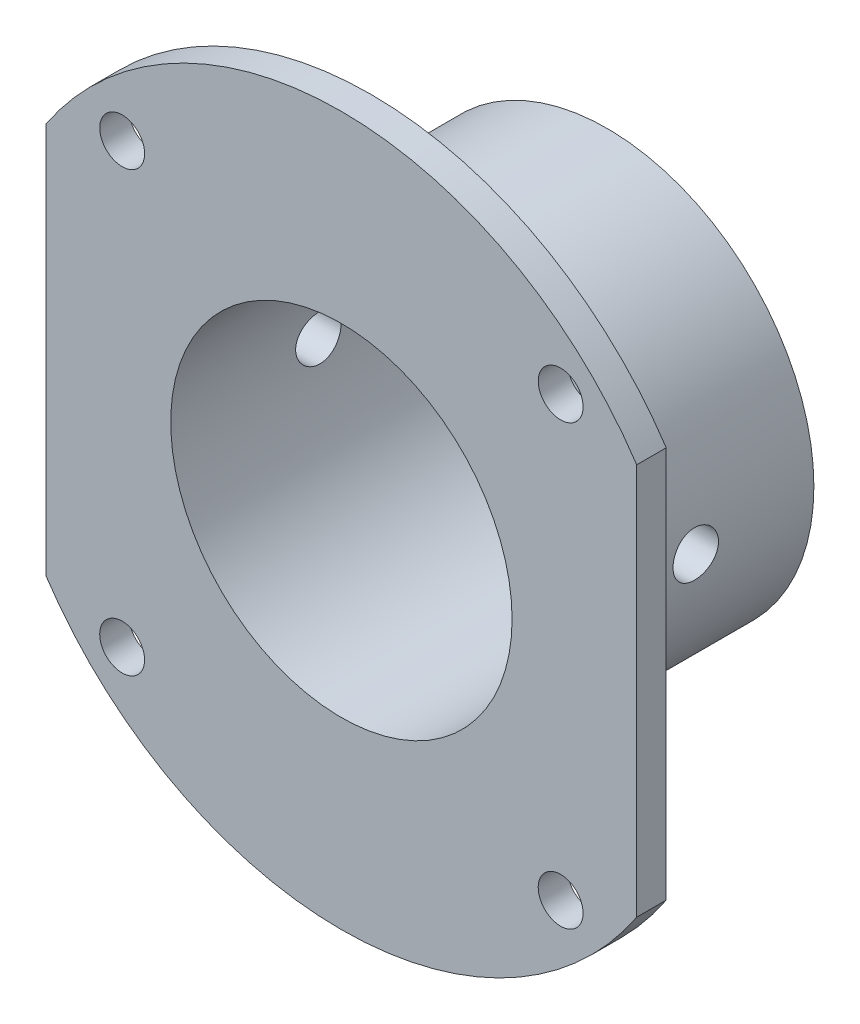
from build123d import *

# Parameters (mm, degrees)
SKETCH1_R          = 44.45
SKETCH1_R_2        = 36.703
EXTRUDE1_DEPTH     = 50.8
SKETCH2_R          = 76.2
EXTRUDE2_DEPTH     = 6.35
SKETCH3_R          = 36.703
CUT_EXTRUDE1_DEPTH = 122.979516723
SKETCH4_R          = 4.826
CUT_EXTRUDE2_DEPTH = 122.979516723
CIRPATTERN1_COUNT  = 4
SKETCH5_R          = 4.8895
CUT_EXTRUDE3_DEPTH = 154.717224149
SKETCH7_W          = 29.494270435
SKETCH7_H          = 152.4
CUT_EXTRUDE4_DEPTH = 122.97951677


with BuildPart() as part:
    # Sketch1 → Extrude1 (new body)
    with BuildSketch(Plane.XY):
        Circle(SKETCH1_R)
        Circle(SKETCH1_R_2, mode=Mode.SUBTRACT)
    extrude(amount=EXTRUDE1_DEPTH)

    # Sketch2 → Extrude2 (add)
    with BuildSketch(Plane.XY.offset(50.8)):
        Circle(SKETCH2_R)
    extrude(amount=EXTRUDE2_DEPTH)

    # Sketch3 → Cut-Extrude1 (cut, through all)
    with BuildSketch(Plane.XY.offset(57.15)):
        Circle(SKETCH3_R)
    extrude(amount=-CUT_EXTRUDE1_DEPTH, mode=Mode.SUBTRACT)

    # Sketch4 → Cut-Extrude2 (cut, through all)
    with BuildSketch(Plane.XY.offset(57.15)):
        with Locations((47.150288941, 47.1424)):
            Circle(SKETCH4_R)
    cut_extrude2 = extrude(amount=-CUT_EXTRUDE2_DEPTH, mode=Mode.SUBTRACT)

    # CirPattern1: Cut-Extrude2 ×4 about axis
    cirpattern1_axis = Axis((0, 0, 0), (0, 0, 1))
    for i in range(1, CIRPATTERN1_COUNT):
        add(cut_extrude2.rotate(cirpattern1_axis, i * 360 / CIRPATTERN1_COUNT), mode=Mode.SUBTRACT)

    # Sketch5 → Cut-Extrude3 (cut, through all)
    with BuildSketch(Plane(origin=(44.45, 0, 0), x_dir=(0, 0, -1), z_dir=(1, 0, 0))):
        with Locations((-25.4, 0)):
            Circle(SKETCH5_R)
    extrude(amount=-CUT_EXTRUDE3_DEPTH, mode=Mode.SUBTRACT)

    # Sketch7 → Cut-Extrude4 (cut, through all)
    with BuildSketch(Plane.XY.offset(57.15)):
        with Locations((78.247135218, 0)):
            Rectangle(SKETCH7_W, SKETCH7_H)
    cut_extrude4 = extrude(amount=-CUT_EXTRUDE4_DEPTH, mode=Mode.SUBTRACT)

    # Mirror1: Cut-Extrude4 across plane
    add(cut_extrude4.mirror(Plane(origin=(0, 0, 0), x_dir=(0, 0, 1), z_dir=(1, 0, 0))), mode=Mode.SUBTRACT)


solid = part.part
